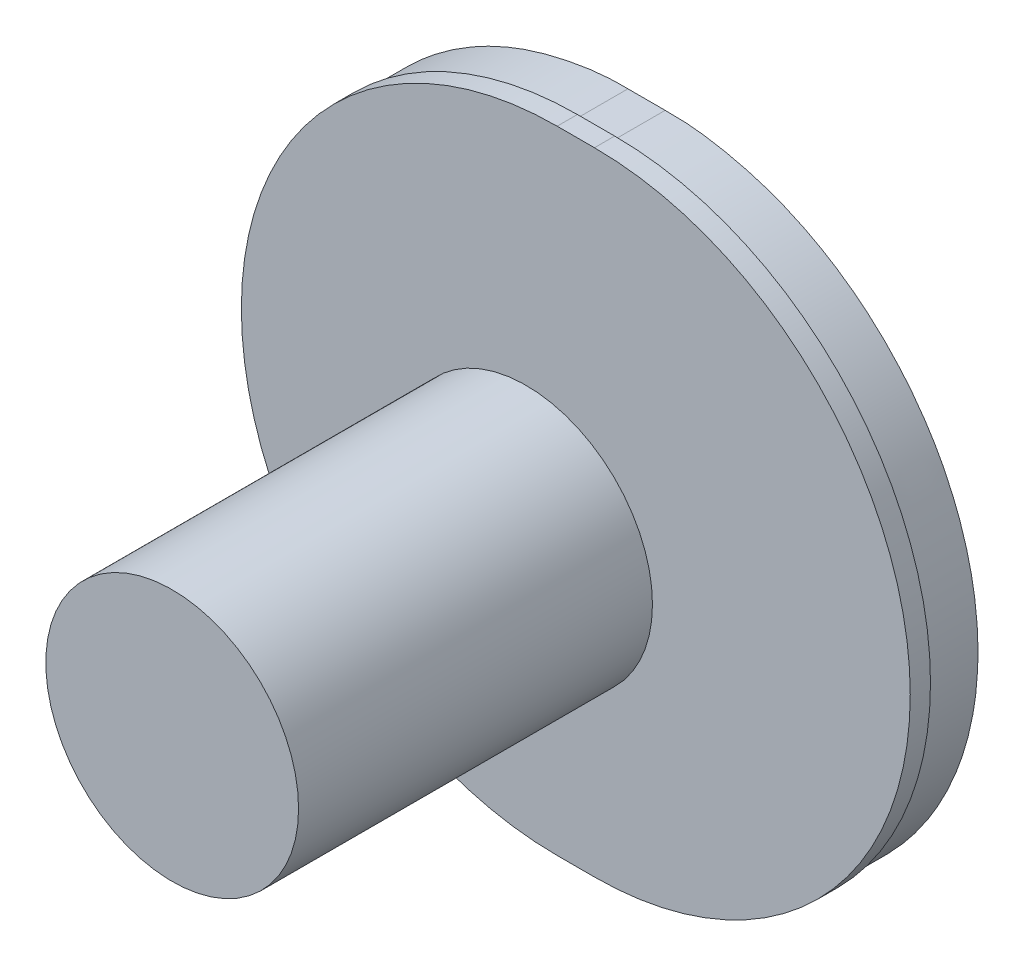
ISO-10303-21;
HEADER;
FILE_DESCRIPTION(('STEP AP214'),'2;1');
FILE_NAME('part.step','',(''),(''),'','','');
FILE_SCHEMA(('AUTOMOTIVE_DESIGN { 1 0 10303 214 1 1 1 1 }'));
ENDSEC;
DATA;
#1=APPLICATION_CONTEXT('core data for automotive mechanical design processes');
#2=APPLICATION_PROTOCOL_DEFINITION('international standard','automotive_design',2000,#1);
#3=PRODUCT_CONTEXT('',#1,'mechanical');
#4=PRODUCT('Part','Part','',(#3));
#5=PRODUCT_RELATED_PRODUCT_CATEGORY('part','',(#4));
#6=PRODUCT_DEFINITION_FORMATION('','',#4);
#7=PRODUCT_DEFINITION_CONTEXT('part definition',#1,'design');
#8=PRODUCT_DEFINITION('design','',#6,#7);
#9=PRODUCT_DEFINITION_SHAPE('','',#8);
#10=(LENGTH_UNIT() NAMED_UNIT(*) SI_UNIT(.MILLI.,.METRE.));
#11=(NAMED_UNIT(*) PLANE_ANGLE_UNIT() SI_UNIT($,.RADIAN.));
#12=(NAMED_UNIT(*) SI_UNIT($,.STERADIAN.) SOLID_ANGLE_UNIT());
#13=UNCERTAINTY_MEASURE_WITH_UNIT(LENGTH_MEASURE(1.E-05),#10,'distance_accuracy_value','');
#14=(GEOMETRIC_REPRESENTATION_CONTEXT(3) GLOBAL_UNCERTAINTY_ASSIGNED_CONTEXT((#13)) GLOBAL_UNIT_ASSIGNED_CONTEXT((#10,
#11,#12)) REPRESENTATION_CONTEXT('',''));
#15=CARTESIAN_POINT('',(0.,0.,0.));
#16=DIRECTION('',(0.,0.,1.));
#17=DIRECTION('',(1.,0.,0.));
#18=AXIS2_PLACEMENT_3D('',#15,#16,#17);
#19=CARTESIAN_POINT('',(0.,0.,35.4593662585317));
#20=DIRECTION('',(0.,0.,1.));
#21=DIRECTION('',(1.,0.,0.));
#22=AXIS2_PLACEMENT_3D('',#19,#20,#21);
#23=CYLINDRICAL_SURFACE('',#22,12.5);
#24=CARTESIAN_POINT('',(0.,0.,35.4593662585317));
#25=DIRECTION('',(0.,0.,1.));
#26=DIRECTION('',(1.,0.,0.));
#27=AXIS2_PLACEMENT_3D('',#24,#25,#26);
#28=CIRCLE('',#27,12.5);
#29=CARTESIAN_POINT('',(12.5,0.,35.4593662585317));
#30=VERTEX_POINT('',#29);
#31=EDGE_CURVE('E280',#30,#30,#28,.T.);
#32=ORIENTED_EDGE('',*,*,#31,.T.);
#33=EDGE_LOOP('',(#32));
#34=FACE_BOUND('',#33,.T.);
#35=CARTESIAN_POINT('',(0.,0.,70.4593662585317));
#36=DIRECTION('',(0.,0.,1.));
#37=DIRECTION('',(1.,0.,0.));
#38=AXIS2_PLACEMENT_3D('',#35,#36,#37);
#39=CIRCLE('',#38,12.5);
#40=CARTESIAN_POINT('',(12.5,0.,70.4593662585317));
#41=VERTEX_POINT('',#40);
#42=EDGE_CURVE('E275',#41,#41,#39,.T.);
#43=ORIENTED_EDGE('',*,*,#42,.F.);
#44=EDGE_LOOP('',(#43));
#45=FACE_BOUND('',#44,.T.);
#46=ADVANCED_FACE('F272',(#34,#45),#23,.T.);
#47=CARTESIAN_POINT('',(0.,0.,35.4593662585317));
#48=DIRECTION('',(0.,0.,1.));
#49=DIRECTION('',(1.,0.,0.));
#50=AXIS2_PLACEMENT_3D('',#47,#48,#49);
#51=PLANE('',#50);
#52=CARTESIAN_POINT('',(0.,0.,35.4593662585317));
#53=DIRECTION('',(0.,0.,-1.));
#54=DIRECTION('',(-1.,0.,0.));
#55=AXIS2_PLACEMENT_3D('',#52,#53,#54);
#56=CIRCLE('',#55,5.);
#57=CARTESIAN_POINT('',(-5.,0.,35.4593662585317));
#58=VERTEX_POINT('',#57);
#59=EDGE_CURVE('E14',#58,#58,#56,.T.);
#60=ORIENTED_EDGE('',*,*,#59,.F.);
#61=EDGE_LOOP('',(#60));
#62=FACE_BOUND('',#61,.T.);
#63=ORIENTED_EDGE('',*,*,#31,.F.);
#64=EDGE_LOOP('',(#63));
#65=FACE_BOUND('',#64,.T.);
#66=ADVANCED_FACE('F522',(#62,#65),#51,.F.);
#67=CARTESIAN_POINT('',(0.,0.,70.4593662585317));
#68=DIRECTION('',(0.,0.,1.));
#69=DIRECTION('',(1.,0.,0.));
#70=AXIS2_PLACEMENT_3D('',#67,#68,#69);
#71=PLANE('',#70);
#72=ORIENTED_EDGE('',*,*,#42,.T.);
#73=EDGE_LOOP('',(#72));
#74=FACE_BOUND('',#73,.T.);
#75=ADVANCED_FACE('F519',(#74),#71,.T.);
#76=CARTESIAN_POINT('',(0.,0.,30.4593662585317));
#77=DIRECTION('',(0.,0.,1.));
#78=DIRECTION('',(1.,0.,0.));
#79=AXIS2_PLACEMENT_3D('',#76,#77,#78);
#80=CYLINDRICAL_SURFACE('',#79,5.);
#81=CARTESIAN_POINT('',(0.,0.,30.4593662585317));
#82=DIRECTION('',(0.,0.,-1.));
#83=DIRECTION('',(-1.,0.,0.));
#84=AXIS2_PLACEMENT_3D('',#81,#82,#83);
#85=CIRCLE('',#84,5.);
#86=CARTESIAN_POINT('',(-5.,0.,30.4593662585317));
#87=VERTEX_POINT('',#86);
#88=EDGE_CURVE('E511',#87,#87,#85,.T.);
#89=ORIENTED_EDGE('',*,*,#88,.F.);
#90=EDGE_LOOP('',(#89));
#91=FACE_BOUND('',#90,.T.);
#92=ORIENTED_EDGE('',*,*,#59,.T.);
#93=EDGE_LOOP('',(#92));
#94=FACE_BOUND('',#93,.T.);
#95=ADVANCED_FACE('F531',(#91,#94),#80,.T.);
#96=CARTESIAN_POINT('',(1.76409122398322,0.,28.4593662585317));
#97=DIRECTION('',(0.,0.,1.));
#98=DIRECTION('',(1.,0.,0.));
#99=AXIS2_PLACEMENT_3D('',#96,#97,#98);
#100=CYLINDRICAL_SURFACE('',#99,31.23281308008);
#101=CARTESIAN_POINT('',(1.76409122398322,0.,30.4593662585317));
#102=DIRECTION('',(0.,0.,-1.));
#103=DIRECTION('',(-1.,0.,0.));
#104=AXIS2_PLACEMENT_3D('',#101,#102,#103);
#105=CIRCLE('',#104,31.23281308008);
#106=CARTESIAN_POINT('',(1.76409122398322,31.23281308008,30.4593662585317));
#107=VERTEX_POINT('',#106);
#108=CARTESIAN_POINT('',(1.76409122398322,-31.23281308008,30.4593662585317));
#109=VERTEX_POINT('',#108);
#110=EDGE_CURVE('E491',#107,#109,#105,.T.);
#111=ORIENTED_EDGE('',*,*,#110,.T.);
#112=DIRECTION('',(0.,0.,1.));
#113=VECTOR('',#112,1.);
#114=CARTESIAN_POINT('',(1.76409122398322,-31.23281308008,28.4593662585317));
#115=LINE('',#114,#113);
#116=CARTESIAN_POINT('',(1.76409122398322,-31.23281308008,28.4593662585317));
#117=VERTEX_POINT('',#116);
#118=EDGE_CURVE('E508',#117,#109,#115,.T.);
#119=ORIENTED_EDGE('',*,*,#118,.F.);
#120=CARTESIAN_POINT('',(1.76409122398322,0.,28.4593662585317));
#121=DIRECTION('',(0.,0.,-1.));
#122=DIRECTION('',(-1.,0.,0.));
#123=AXIS2_PLACEMENT_3D('',#120,#121,#122);
#124=CIRCLE('',#123,31.23281308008);
#125=CARTESIAN_POINT('',(1.76409122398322,31.23281308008,28.4593662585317));
#126=VERTEX_POINT('',#125);
#127=EDGE_CURVE('E480',#126,#117,#124,.T.);
#128=ORIENTED_EDGE('',*,*,#127,.F.);
#129=DIRECTION('',(0.,0.,1.));
#130=VECTOR('',#129,1.);
#131=CARTESIAN_POINT('',(1.76409122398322,31.23281308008,28.4593662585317));
#132=LINE('',#131,#130);
#133=EDGE_CURVE('E490',#126,#107,#132,.T.);
#134=ORIENTED_EDGE('',*,*,#133,.T.);
#135=EDGE_LOOP('',(#111,#119,#128,#134));
#136=FACE_BOUND('',#135,.T.);
#137=ADVANCED_FACE('F537',(#136),#100,.T.);
#138=CARTESIAN_POINT('',(1.76409122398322,-31.23281308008,28.4593662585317));
#139=DIRECTION('',(0.,1.,0.));
#140=DIRECTION('',(0.,0.,1.));
#141=AXIS2_PLACEMENT_3D('',#138,#139,#140);
#142=PLANE('',#141);
#143=DIRECTION('',(-1.,0.,0.));
#144=VECTOR('',#143,1.);
#145=CARTESIAN_POINT('',(1.76409122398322,-31.23281308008,30.4593662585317));
#146=LINE('',#145,#144);
#147=CARTESIAN_POINT('',(-1.9264467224,-31.23281308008,30.4593662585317));
#148=VERTEX_POINT('',#147);
#149=EDGE_CURVE('E494',#109,#148,#146,.T.);
#150=ORIENTED_EDGE('',*,*,#149,.T.);
#151=DIRECTION('',(0.,0.,1.));
#152=VECTOR('',#151,1.);
#153=CARTESIAN_POINT('',(-1.9264467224,-31.23281308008,28.4593662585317));
#154=LINE('',#153,#152);
#155=CARTESIAN_POINT('',(-1.9264467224,-31.23281308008,28.4593662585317));
#156=VERTEX_POINT('',#155);
#157=EDGE_CURVE('E505',#156,#148,#154,.T.);
#158=ORIENTED_EDGE('',*,*,#157,.F.);
#159=DIRECTION('',(-1.,0.,0.));
#160=VECTOR('',#159,1.);
#161=CARTESIAN_POINT('',(1.76409122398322,-31.23281308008,28.4593662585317));
#162=LINE('',#161,#160);
#163=EDGE_CURVE('E483',#117,#156,#162,.T.);
#164=ORIENTED_EDGE('',*,*,#163,.F.);
#165=ORIENTED_EDGE('',*,*,#118,.T.);
#166=EDGE_LOOP('',(#150,#158,#164,#165));
#167=FACE_BOUND('',#166,.T.);
#168=ADVANCED_FACE('F541',(#167),#142,.F.);
#169=CARTESIAN_POINT('',(-1.92644672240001,0.,28.4593662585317));
#170=DIRECTION('',(0.,0.,1.));
#171=DIRECTION('',(1.,0.,0.));
#172=AXIS2_PLACEMENT_3D('',#169,#170,#171);
#173=CYLINDRICAL_SURFACE('',#172,31.23281308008);
#174=CARTESIAN_POINT('',(-1.92644672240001,0.,30.4593662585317));
#175=DIRECTION('',(0.,0.,-1.));
#176=DIRECTION('',(-1.,0.,0.));
#177=AXIS2_PLACEMENT_3D('',#174,#175,#176);
#178=CIRCLE('',#177,31.23281308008);
#179=CARTESIAN_POINT('',(-1.92644672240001,31.23281308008,30.4593662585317));
#180=VERTEX_POINT('',#179);
#181=EDGE_CURVE('E497',#148,#180,#178,.T.);
#182=ORIENTED_EDGE('',*,*,#181,.T.);
#183=DIRECTION('',(0.,0.,1.));
#184=VECTOR('',#183,1.);
#185=CARTESIAN_POINT('',(-1.92644672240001,31.23281308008,28.4593662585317));
#186=LINE('',#185,#184);
#187=CARTESIAN_POINT('',(-1.92644672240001,31.23281308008,28.4593662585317));
#188=VERTEX_POINT('',#187);
#189=EDGE_CURVE('E502',#188,#180,#186,.T.);
#190=ORIENTED_EDGE('',*,*,#189,.F.);
#191=CARTESIAN_POINT('',(-1.92644672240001,0.,28.4593662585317));
#192=DIRECTION('',(0.,0.,-1.));
#193=DIRECTION('',(-1.,0.,0.));
#194=AXIS2_PLACEMENT_3D('',#191,#192,#193);
#195=CIRCLE('',#194,31.23281308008);
#196=EDGE_CURVE('E486',#156,#188,#195,.T.);
#197=ORIENTED_EDGE('',*,*,#196,.F.);
#198=ORIENTED_EDGE('',*,*,#157,.T.);
#199=EDGE_LOOP('',(#182,#190,#197,#198));
#200=FACE_BOUND('',#199,.T.);
#201=ADVANCED_FACE('F545',(#200),#173,.T.);
#202=CARTESIAN_POINT('',(1.76409122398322,31.23281308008,28.4593662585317));
#203=DIRECTION('',(0.,-1.,0.));
#204=DIRECTION('',(0.,0.,-1.));
#205=AXIS2_PLACEMENT_3D('',#202,#203,#204);
#206=PLANE('',#205);
#207=DIRECTION('',(1.,0.,0.));
#208=VECTOR('',#207,1.);
#209=CARTESIAN_POINT('',(1.76409122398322,31.23281308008,30.4593662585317));
#210=LINE('',#209,#208);
#211=EDGE_CURVE('E484',#180,#107,#210,.T.);
#212=ORIENTED_EDGE('',*,*,#211,.T.);
#213=ORIENTED_EDGE('',*,*,#133,.F.);
#214=DIRECTION('',(1.,0.,0.));
#215=VECTOR('',#214,1.);
#216=CARTESIAN_POINT('',(1.76409122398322,31.23281308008,28.4593662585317));
#217=LINE('',#216,#215);
#218=EDGE_CURVE('E488',#188,#126,#217,.T.);
#219=ORIENTED_EDGE('',*,*,#218,.F.);
#220=ORIENTED_EDGE('',*,*,#189,.T.);
#221=EDGE_LOOP('',(#212,#213,#219,#220));
#222=FACE_BOUND('',#221,.T.);
#223=ADVANCED_FACE('F549',(#222),#206,.F.);
#224=CARTESIAN_POINT('',(1.76409122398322,0.,28.4593662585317));
#225=DIRECTION('',(0.,0.,-1.));
#226=DIRECTION('',(-1.,0.,0.));
#227=AXIS2_PLACEMENT_3D('',#224,#225,#226);
#228=PLANE('',#227);
#229=DIRECTION('',(-1.,0.,0.));
#230=VECTOR('',#229,1.);
#231=CARTESIAN_POINT('',(1.7639688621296,-30.93281308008,28.4593662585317));
#232=LINE('',#231,#230);
#233=CARTESIAN_POINT('',(1.7639688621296,-30.93281308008,28.4593662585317));
#234=VERTEX_POINT('',#233);
#235=CARTESIAN_POINT('',(-1.92644672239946,-30.93281308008,28.4593662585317));
#236=VERTEX_POINT('',#235);
#237=EDGE_CURVE('E288',#234,#236,#232,.T.);
#238=ORIENTED_EDGE('',*,*,#237,.F.);
#239=CARTESIAN_POINT('',(1.75912008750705,30.93281308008,28.4593662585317));
#240=CARTESIAN_POINT('',(1.76011431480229,30.93281308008,28.4593662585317));
#241=CARTESIAN_POINT('',(1.76110854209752,30.93281308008,28.4593662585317));
#242=CARTESIAN_POINT('',(2.12252526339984,30.9328130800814,28.4593662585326));
#243=CARTESIAN_POINT('',(2.48394212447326,30.932820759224,28.4593662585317));
#244=CARTESIAN_POINT('',(2.84530803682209,30.9300292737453,28.4593662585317));
#245=CARTESIAN_POINT('',(3.92611949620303,30.9049750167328,28.4593662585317));
#246=CARTESIAN_POINT('',(5.00556288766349,30.8047579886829,28.4593662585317));
#247=CARTESIAN_POINT('',(5.72347820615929,30.7101881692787,28.4593662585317));
#248=CARTESIAN_POINT('',(7.51121853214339,30.4184854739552,28.4593662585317));
#249=CARTESIAN_POINT('',(9.27442906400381,30.0238824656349,28.4593662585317));
#250=CARTESIAN_POINT('',(10.3210907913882,29.746687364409,28.4593662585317));
#251=CARTESIAN_POINT('',(12.3870173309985,29.1046522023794,28.4593662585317));
#252=CARTESIAN_POINT('',(14.3884145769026,28.2737703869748,28.4593662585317));
#253=CARTESIAN_POINT('',(15.3704111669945,27.8133904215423,28.4593662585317));
#254=CARTESIAN_POINT('',(17.2918608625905,26.8072975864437,28.4593662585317));
#255=CARTESIAN_POINT('',(19.1179447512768,25.6396293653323,28.4593662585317));
#256=CARTESIAN_POINT('',(20.0048987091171,25.0166970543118,28.4593662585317));
#257=CARTESIAN_POINT('',(21.7221375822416,23.6952273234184,28.4593662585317));
#258=CARTESIAN_POINT('',(23.3170522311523,22.227729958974,28.4593662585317));
#259=CARTESIAN_POINT('',(24.0819718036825,21.4595137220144,28.4593662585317));
#260=CARTESIAN_POINT('',(25.5428220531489,19.8582248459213,28.4593662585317));
#261=CARTESIAN_POINT('',(26.8578677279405,18.1353805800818,28.4593662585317));
#262=CARTESIAN_POINT('',(27.4773596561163,17.2458187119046,28.4593662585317));
#263=CARTESIAN_POINT('',(28.6371221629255,15.4149137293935,28.4593662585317));
#264=CARTESIAN_POINT('',(29.6321229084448,13.4894427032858,28.4593662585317));
#265=CARTESIAN_POINT('',(30.0872709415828,12.5055822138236,28.4593662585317));
#266=CARTESIAN_POINT('',(30.9105385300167,10.5006443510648,28.4593662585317));
#267=CARTESIAN_POINT('',(31.5551015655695,8.43133885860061,28.4593662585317));
#268=CARTESIAN_POINT('',(31.8320003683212,7.38326747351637,28.4593662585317));
#269=CARTESIAN_POINT('',(32.2936193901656,5.26563396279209,28.4593662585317));
#270=CARTESIAN_POINT('',(32.568054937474,3.11571204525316,28.4593662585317));
#271=CARTESIAN_POINT('',(32.658246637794,2.03543622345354,28.4593662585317));
#272=CARTESIAN_POINT('',(32.7441174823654,-0.130230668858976,28.4593662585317));
#273=CARTESIAN_POINT('',(32.6400423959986,-2.29509910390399,28.4593662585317));
#274=CARTESIAN_POINT('',(32.5407717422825,-3.37457849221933,28.4593662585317));
#275=CARTESIAN_POINT('',(32.248270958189,-5.52211718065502,28.4593662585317));
#276=CARTESIAN_POINT('',(31.7688647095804,-7.63579483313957,28.4593662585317));
#277=CARTESIAN_POINT('',(31.4831642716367,-8.68150119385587,28.4593662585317));
#278=CARTESIAN_POINT('',(30.8212268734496,-10.7453145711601,28.4593662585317));
#279=CARTESIAN_POINT('',(29.9811326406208,-12.7432604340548,28.4593662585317));
#280=CARTESIAN_POINT('',(29.5177292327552,-13.723259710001,28.4593662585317));
#281=CARTESIAN_POINT('',(28.5065756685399,-15.6402973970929,28.4593662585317));
#282=CARTESIAN_POINT('',(27.3314602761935,-17.4613862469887,28.4593662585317));
#283=CARTESIAN_POINT('',(26.7045111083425,-18.3457080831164,28.4593662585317));
#284=CARTESIAN_POINT('',(25.3750277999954,-20.057435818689,28.4593662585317));
#285=CARTESIAN_POINT('',(23.900770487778,-21.6463901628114,28.4593662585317));
#286=CARTESIAN_POINT('',(23.1294207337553,-22.4081497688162,28.4593662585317));
#287=CARTESIAN_POINT('',(21.5222238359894,-23.8621854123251,28.4593662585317));
#288=CARTESIAN_POINT('',(19.7939217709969,-25.1691570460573,28.4593662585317));
#289=CARTESIAN_POINT('',(18.9017569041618,-25.7846053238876,28.4593662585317));
#290=CARTESIAN_POINT('',(17.0659244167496,-26.9368837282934,28.4593662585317));
#291=CARTESIAN_POINT('',(15.1361362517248,-27.9268396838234,28.4593662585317));
#292=CARTESIAN_POINT('',(14.1503229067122,-28.3789668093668,28.4593662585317));
#293=CARTESIAN_POINT('',(12.1580395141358,-29.1864765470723,28.4593662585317));
#294=CARTESIAN_POINT('',(10.1036407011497,-29.8074373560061,28.4593662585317));
#295=CARTESIAN_POINT('',(9.07179249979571,-30.0728459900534,28.4593662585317));
#296=CARTESIAN_POINT('',(7.34008596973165,-30.4485461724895,28.4593662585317));
#297=CARTESIAN_POINT('',(5.58574697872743,-30.7250694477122,28.4593662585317));
#298=CARTESIAN_POINT('',(4.88486180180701,-30.814092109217,28.4593662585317));
#299=CARTESIAN_POINT('',(3.83980056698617,-30.9072890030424,28.4593662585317));
#300=CARTESIAN_POINT('',(2.79346652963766,-30.9302991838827,28.4593662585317));
#301=CARTESIAN_POINT('',(2.4503385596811,-30.9328132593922,28.4593662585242));
#302=CARTESIAN_POINT('',(2.10716597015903,-30.932813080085,28.4593662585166));
#303=CARTESIAN_POINT('',(1.76399333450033,-30.93281308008,28.4593662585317));
#304=CARTESIAN_POINT('',(1.7639688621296,-30.93281308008,28.4593662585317));
#305=B_SPLINE_CURVE_WITH_KNOTS('',5,(#239,#240,#241,#242,#243,#244,#245,#246,#247,#248,#249,
#250,#251,#252,#253,#254,#255,#256,#257,#258,#259,#260,#261,#262,#263,#264,#265,#266,#267,#268,
#269,#270,#271,#272,#273,#274,#275,#276,#277,#278,#279,#280,#281,#282,#283,#284,#285,#286,#287,
#288,#289,#290,#291,#292,#293,#294,#295,#296,#297,#298,#299,#300,#301,#302,#303,#304),
.UNSPECIFIED.,.F.,.F.,(6,2,3,3,3,3,3,3,3,3,3,3,3,3,3,3,3,3,3,3,3,1,6),(0.,5.12171215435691E-05,
0.0186182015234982,0.0557521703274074,0.111453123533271,0.167154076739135,0.222855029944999,
0.278555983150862,0.334256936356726,0.38995788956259,0.445658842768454,0.501359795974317,
0.557060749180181,0.612761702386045,0.668462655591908,0.724163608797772,0.779864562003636,
0.8355655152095,0.891266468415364,0.94607754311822,0.982321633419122,0.99999873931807,1.),.UNSPECIFIED.);
#306=CARTESIAN_POINT('',(1.75912008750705,30.93281308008,28.4593662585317));
#307=VERTEX_POINT('',#306);
#308=EDGE_CURVE('E293',#307,#234,#305,.T.);
#309=ORIENTED_EDGE('',*,*,#308,.F.);
#310=DIRECTION('',(1.,0.,0.));
#311=VECTOR('',#310,1.);
#312=CARTESIAN_POINT('',(-1.92644672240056,30.93281308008,28.4593662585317));
#313=LINE('',#312,#311);
#314=CARTESIAN_POINT('',(-1.92644672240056,30.93281308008,28.4593662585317));
#315=VERTEX_POINT('',#314);
#316=EDGE_CURVE('E651',#315,#307,#313,.T.);
#317=ORIENTED_EDGE('',*,*,#316,.F.);
#318=CARTESIAN_POINT('',(-1.92644672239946,-30.93281308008,28.4593662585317));
#319=CARTESIAN_POINT('',(-2.2868692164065,-30.93281308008,28.4593662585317));
#320=CARTESIAN_POINT('',(-2.64729171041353,-30.93281308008,28.4593662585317));
#321=CARTESIAN_POINT('',(-3.00766353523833,-30.9300292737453,28.4593662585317));
#322=CARTESIAN_POINT('',(-4.08847499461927,-30.9049750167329,28.4593662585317));
#323=CARTESIAN_POINT('',(-5.16791838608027,-30.8047579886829,28.4593662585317));
#324=CARTESIAN_POINT('',(-5.88583370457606,-30.7101881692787,28.4593662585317));
#325=CARTESIAN_POINT('',(-7.67357403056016,-30.4184854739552,28.4593662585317));
#326=CARTESIAN_POINT('',(-9.43678456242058,-30.0238824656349,28.4593662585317));
#327=CARTESIAN_POINT('',(-10.483446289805,-29.746687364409,28.4593662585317));
#328=CARTESIAN_POINT('',(-12.5493728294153,-29.1046522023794,28.4593662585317));
#329=CARTESIAN_POINT('',(-14.5507700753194,-28.2737703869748,28.4593662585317));
#330=CARTESIAN_POINT('',(-15.5327666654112,-27.8133904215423,28.4593662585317));
#331=CARTESIAN_POINT('',(-17.4542163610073,-26.8072975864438,28.4593662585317));
#332=CARTESIAN_POINT('',(-19.2803002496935,-25.6396293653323,28.4593662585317));
#333=CARTESIAN_POINT('',(-20.1672542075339,-25.0166970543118,28.4593662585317));
#334=CARTESIAN_POINT('',(-21.8844930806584,-23.6952273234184,28.4593662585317));
#335=CARTESIAN_POINT('',(-23.4794077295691,-22.227729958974,28.4593662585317));
#336=CARTESIAN_POINT('',(-24.2443273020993,-21.4595137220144,28.4593662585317));
#337=CARTESIAN_POINT('',(-25.7051775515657,-19.8582248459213,28.4593662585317));
#338=CARTESIAN_POINT('',(-27.0202232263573,-18.1353805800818,28.4593662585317));
#339=CARTESIAN_POINT('',(-27.6397151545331,-17.2458187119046,28.4593662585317));
#340=CARTESIAN_POINT('',(-28.7994776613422,-15.4149137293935,28.4593662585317));
#341=CARTESIAN_POINT('',(-29.7944784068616,-13.4894427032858,28.4593662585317));
#342=CARTESIAN_POINT('',(-30.2496264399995,-12.5055822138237,28.4593662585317));
#343=CARTESIAN_POINT('',(-31.0728940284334,-10.5006443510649,28.4593662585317));
#344=CARTESIAN_POINT('',(-31.7174570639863,-8.43133885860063,28.4593662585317));
#345=CARTESIAN_POINT('',(-31.994355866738,-7.38326747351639,28.4593662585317));
#346=CARTESIAN_POINT('',(-32.4559748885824,-5.26563396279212,28.4593662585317));
#347=CARTESIAN_POINT('',(-32.7304104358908,-3.11571204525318,28.4593662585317));
#348=CARTESIAN_POINT('',(-32.8206021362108,-2.03543622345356,28.4593662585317));
#349=CARTESIAN_POINT('',(-32.9064729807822,0.130230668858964,28.4593662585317));
#350=CARTESIAN_POINT('',(-32.8023978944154,2.29509910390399,28.4593662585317));
#351=CARTESIAN_POINT('',(-32.7031272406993,3.37457849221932,28.4593662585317));
#352=CARTESIAN_POINT('',(-32.4106264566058,5.52211718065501,28.4593662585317));
#353=CARTESIAN_POINT('',(-31.9312202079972,7.63579483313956,28.4593662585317));
#354=CARTESIAN_POINT('',(-31.6455197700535,8.68150119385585,28.4593662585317));
#355=CARTESIAN_POINT('',(-30.9835823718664,10.7453145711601,28.4593662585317));
#356=CARTESIAN_POINT('',(-30.1434881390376,12.7432604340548,28.4593662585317));
#357=CARTESIAN_POINT('',(-29.680084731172,13.723259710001,28.4593662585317));
#358=CARTESIAN_POINT('',(-28.6689311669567,15.6402973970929,28.4593662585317));
#359=CARTESIAN_POINT('',(-27.4938157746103,17.4613862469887,28.4593662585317));
#360=CARTESIAN_POINT('',(-26.8668666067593,18.3457080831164,28.4593662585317));
#361=CARTESIAN_POINT('',(-25.5373832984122,20.057435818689,28.4593662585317));
#362=CARTESIAN_POINT('',(-24.0631259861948,21.6463901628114,28.4593662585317));
#363=CARTESIAN_POINT('',(-23.2917762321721,22.4081497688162,28.4593662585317));
#364=CARTESIAN_POINT('',(-21.6845793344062,23.8621854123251,28.4593662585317));
#365=CARTESIAN_POINT('',(-19.9562772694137,25.1691570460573,28.4593662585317));
#366=CARTESIAN_POINT('',(-19.0641124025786,25.7846053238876,28.4593662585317));
#367=CARTESIAN_POINT('',(-17.2282799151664,26.9368837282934,28.4593662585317));
#368=CARTESIAN_POINT('',(-15.2984917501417,27.9268396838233,28.4593662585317));
#369=CARTESIAN_POINT('',(-14.312678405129,28.3789668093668,28.4593662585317));
#370=CARTESIAN_POINT('',(-12.3203950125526,29.1864765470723,28.4593662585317));
#371=CARTESIAN_POINT('',(-10.2659961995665,29.8074373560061,28.4593662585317));
#372=CARTESIAN_POINT('',(-9.23414799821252,30.0728459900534,28.4593662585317));
#373=CARTESIAN_POINT('',(-7.50244146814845,30.4485461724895,28.4593662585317));
#374=CARTESIAN_POINT('',(-5.74810247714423,30.7250694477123,28.4593662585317));
#375=CARTESIAN_POINT('',(-5.04721730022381,30.814092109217,28.4593662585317));
#376=CARTESIAN_POINT('',(-4.00215606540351,30.9072890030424,28.4593662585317));
#377=CARTESIAN_POINT('',(-2.95584649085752,30.9302986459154,28.4593662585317));
#378=CARTESIAN_POINT('',(-2.6127430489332,30.93281308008,28.4593662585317));
#379=CARTESIAN_POINT('',(-2.26959488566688,30.93281308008,28.4593662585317));
#380=CARTESIAN_POINT('',(-1.92644672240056,30.93281308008,28.4593662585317));
#381=B_SPLINE_CURVE_WITH_KNOTS('',5,(#318,#319,#320,#321,#322,#323,#324,#325,#326,#327,#328,
#329,#330,#331,#332,#333,#334,#335,#336,#337,#338,#339,#340,#341,#342,#343,#344,#345,#346,#347,
#348,#349,#350,#351,#352,#353,#354,#355,#356,#357,#358,#359,#360,#361,#362,#363,#364,#365,#366,
#367,#368,#369,#370,#371,#372,#373,#374,#375,#376,#377,#378,#379,#380),.UNSPECIFIED.,.F.,.F.,(6,
3,3,3,3,3,3,3,3,3,3,3,3,3,3,3,3,3,3,3,6),(0.,0.0185679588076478,0.0557038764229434,
0.111407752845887,0.16711162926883,0.222815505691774,0.278519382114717,0.33422325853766,
0.389927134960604,0.445631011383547,0.501334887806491,0.557038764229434,0.612742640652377,
0.668446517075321,0.724150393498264,0.779854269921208,0.835558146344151,0.891262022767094,
0.946075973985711,0.982321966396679,1.),.UNSPECIFIED.);
#382=EDGE_CURVE('E495',#236,#315,#381,.T.);
#383=ORIENTED_EDGE('',*,*,#382,.F.);
#384=EDGE_LOOP('',(#238,#309,#317,#383));
#385=FACE_BOUND('',#384,.T.);
#386=ORIENTED_EDGE('',*,*,#127,.T.);
#387=ORIENTED_EDGE('',*,*,#163,.T.);
#388=ORIENTED_EDGE('',*,*,#196,.T.);
#389=ORIENTED_EDGE('',*,*,#218,.T.);
#390=EDGE_LOOP('',(#386,#387,#388,#389));
#391=FACE_BOUND('',#390,.T.);
#392=ADVANCED_FACE('F553',(#385,#391),#228,.T.);
#393=CARTESIAN_POINT('',(1.76409122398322,0.,30.4593662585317));
#394=DIRECTION('',(0.,0.,-1.));
#395=DIRECTION('',(-1.,0.,0.));
#396=AXIS2_PLACEMENT_3D('',#393,#394,#395);
#397=PLANE('',#396);
#398=ORIENTED_EDGE('',*,*,#88,.T.);
#399=EDGE_LOOP('',(#398));
#400=FACE_BOUND('',#399,.T.);
#401=ORIENTED_EDGE('',*,*,#110,.F.);
#402=ORIENTED_EDGE('',*,*,#211,.F.);
#403=ORIENTED_EDGE('',*,*,#181,.F.);
#404=ORIENTED_EDGE('',*,*,#149,.F.);
#405=EDGE_LOOP('',(#401,#402,#403,#404));
#406=FACE_BOUND('',#405,.T.);
#407=ADVANCED_FACE('F555',(#400,#406),#397,.F.);
#408=CARTESIAN_POINT('',(0.,0.,23.4593662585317));
#409=DIRECTION('',(0.,0.,1.));
#410=DIRECTION('',(1.,0.,0.));
#411=AXIS2_PLACEMENT_3D('',#408,#409,#410);
#412=PLANE('',#411);
#413=CARTESIAN_POINT('',(-1.92644672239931,-27.23281308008,23.4593662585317));
#414=CARTESIAN_POINT('',(-2.24375761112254,-27.23281308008,23.4593662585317));
#415=CARTESIAN_POINT('',(-2.56106849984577,-27.23281308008,23.4593662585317));
#416=CARTESIAN_POINT('',(-2.87833478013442,-27.2303622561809,23.4593662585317));
#417=CARTESIAN_POINT('',(-3.82986597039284,-27.2083048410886,23.4593662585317));
#418=CARTESIAN_POINT('',(-4.78019273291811,-27.1200751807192,23.4593662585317));
#419=CARTESIAN_POINT('',(-5.41223527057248,-27.0368172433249,23.4593662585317));
#420=CARTESIAN_POINT('',(-6.98613668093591,-26.7800062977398,23.4593662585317));
#421=CARTESIAN_POINT('',(-8.5384424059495,-26.4326033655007,23.4593662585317));
#422=CARTESIAN_POINT('',(-9.45990865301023,-26.1885647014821,23.4593662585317));
#423=CARTESIAN_POINT('',(-11.2787212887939,-25.623325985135,23.4593662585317));
#424=CARTESIAN_POINT('',(-13.0407232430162,-24.8918293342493,23.4593662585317));
#425=CARTESIAN_POINT('',(-13.9052592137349,-24.4865172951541,23.4593662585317));
#426=CARTESIAN_POINT('',(-15.5968764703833,-23.6007673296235,23.4593662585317));
#427=CARTESIAN_POINT('',(-17.2045350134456,-22.5727686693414,23.4593662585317));
#428=CARTESIAN_POINT('',(-17.9853967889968,-22.0243478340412,23.4593662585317));
#429=CARTESIAN_POINT('',(-19.4972297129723,-20.8609444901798,23.4593662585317));
#430=CARTESIAN_POINT('',(-20.9013701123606,-19.5689804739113,23.4593662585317));
#431=CARTESIAN_POINT('',(-21.5747945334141,-18.8926537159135,23.4593662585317));
#432=CARTESIAN_POINT('',(-22.8609065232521,-17.4829015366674,23.4593662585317));
#433=CARTESIAN_POINT('',(-24.0186542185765,-15.9661337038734,23.4593662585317));
#434=CARTESIAN_POINT('',(-24.5640461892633,-15.1829759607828,23.4593662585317));
#435=CARTESIAN_POINT('',(-25.5850847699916,-13.5710729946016,23.4593662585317));
#436=CARTESIAN_POINT('',(-26.4610694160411,-11.8759154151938,23.4593662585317));
#437=CARTESIAN_POINT('',(-26.8617753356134,-11.0097384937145,23.4593662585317));
#438=CARTESIAN_POINT('',(-27.5865685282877,-9.24461943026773,23.4593662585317));
#439=CARTESIAN_POINT('',(-28.1540327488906,-7.42283201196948,23.4593662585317));
#440=CARTESIAN_POINT('',(-28.3978105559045,-6.50012472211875,23.4593662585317));
#441=CARTESIAN_POINT('',(-28.8042134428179,-4.63578999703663,23.4593662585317));
#442=CARTESIAN_POINT('',(-29.045822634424,-2.7430290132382,23.4593662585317));
#443=CARTESIAN_POINT('',(-29.1252261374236,-1.79196939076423,23.4593662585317));
#444=CARTESIAN_POINT('',(-29.2008256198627,0.114653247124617,23.4593662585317));
#445=CARTESIAN_POINT('',(-29.1091993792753,2.02057293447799,23.4593662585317));
#446=CARTESIAN_POINT('',(-29.0218028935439,2.97093138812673,23.4593662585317));
#447=CARTESIAN_POINT('',(-28.7642893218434,4.86159421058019,23.4593662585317));
#448=CARTESIAN_POINT('',(-28.3422268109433,6.72244625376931,23.4593662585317));
#449=CARTESIAN_POINT('',(-28.0907001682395,7.64307140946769,23.4593662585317));
#450=CARTESIAN_POINT('',(-27.5079398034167,9.4600236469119,23.4593662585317));
#451=CARTESIAN_POINT('',(-26.768332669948,11.2189870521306,23.4593662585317));
#452=CARTESIAN_POINT('',(-26.3603588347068,12.081764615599,23.4593662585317));
#453=CARTESIAN_POINT('',(-25.4701534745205,13.7694976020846,23.4593662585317));
#454=CARTESIAN_POINT('',(-24.4355984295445,15.3727585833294,23.4593662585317));
#455=CARTESIAN_POINT('',(-23.8836412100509,16.1513030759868,23.4593662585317));
#456=CARTESIAN_POINT('',(-22.713182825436,17.6582840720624,23.4593662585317));
#457=CARTESIAN_POINT('',(-21.4152674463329,19.0571771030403,23.4593662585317));
#458=CARTESIAN_POINT('',(-20.7361819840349,19.7278195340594,23.4593662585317));
#459=CARTESIAN_POINT('',(-19.3212284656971,21.0079320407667,23.4593662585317));
#460=CARTESIAN_POINT('',(-17.7996556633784,22.1585714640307,23.4593662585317));
#461=CARTESIAN_POINT('',(-17.0142062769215,22.7004034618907,23.4593662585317));
#462=CARTESIAN_POINT('',(-15.3979652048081,23.7148531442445,23.4593662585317));
#463=CARTESIAN_POINT('',(-13.6990068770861,24.5863964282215,23.4593662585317));
#464=CARTESIAN_POINT('',(-12.8311106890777,24.9844427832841,23.4593662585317));
#465=CARTESIAN_POINT('',(-11.0771324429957,25.6953629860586,23.4593662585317));
#466=CARTESIAN_POINT('',(-9.26846865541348,26.2420481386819,23.4593662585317));
#467=CARTESIAN_POINT('',(-8.36004402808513,26.4757101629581,23.4593662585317));
#468=CARTESIAN_POINT('',(-6.83547398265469,26.8064713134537,23.4593662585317));
#469=CARTESIAN_POINT('',(-5.29097863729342,27.0499185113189,23.4593662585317));
#470=CARTESIAN_POINT('',(-4.67392919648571,27.1282928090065,23.4593662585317));
#471=CARTESIAN_POINT('',(-3.75387200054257,27.2103420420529,23.4593662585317));
#472=CARTESIAN_POINT('',(-2.8327157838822,27.2305994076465,23.4593662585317));
#473=CARTESIAN_POINT('',(-2.53065234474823,27.23281308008,23.4593662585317));
#474=CARTESIAN_POINT('',(-2.22854953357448,27.23281308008,23.4593662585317));
#475=CARTESIAN_POINT('',(-1.92644672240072,27.23281308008,23.4593662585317));
#476=B_SPLINE_CURVE_WITH_KNOTS('',5,(#413,#414,#415,#416,#417,#418,#419,#420,#421,#422,#423,
#424,#425,#426,#427,#428,#429,#430,#431,#432,#433,#434,#435,#436,#437,#438,#439,#440,#441,#442,
#443,#444,#445,#446,#447,#448,#449,#450,#451,#452,#453,#454,#455,#456,#457,#458,#459,#460,#461,
#462,#463,#464,#465,#466,#467,#468,#469,#470,#471,#472,#473,#474,#475),.UNSPECIFIED.,.F.,.F.,(6,
3,3,3,3,3,3,3,3,3,3,3,3,3,3,3,3,3,3,3,6),(0.,0.0185679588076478,0.0557038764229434,
0.111407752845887,0.16711162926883,0.222815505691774,0.278519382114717,0.33422325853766,
0.389927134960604,0.445631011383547,0.501334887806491,0.557038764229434,0.612742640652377,
0.668446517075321,0.724150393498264,0.779854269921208,0.835558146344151,0.891262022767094,
0.946075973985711,0.982321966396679,1.),.UNSPECIFIED.);
#477=CARTESIAN_POINT('',(-1.92644672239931,-27.23281308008,23.4593662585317));
#478=VERTEX_POINT('',#477);
#479=CARTESIAN_POINT('',(-1.92644672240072,27.23281308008,23.4593662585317));
#480=VERTEX_POINT('',#479);
#481=EDGE_CURVE('E361',#478,#480,#476,.T.);
#482=ORIENTED_EDGE('',*,*,#481,.F.);
#483=DIRECTION('',(-1.,0.,0.));
#484=VECTOR('',#483,1.);
#485=CARTESIAN_POINT('',(1.76409122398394,-27.23281308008,23.4593662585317));
#486=LINE('',#485,#484);
#487=CARTESIAN_POINT('',(1.76409122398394,-27.23281308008,23.4593662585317));
#488=VERTEX_POINT('',#487);
#489=EDGE_CURVE('E694',#488,#478,#486,.T.);
#490=ORIENTED_EDGE('',*,*,#489,.F.);
#491=CARTESIAN_POINT('',(1.76409122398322,27.23281308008,23.4593662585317));
#492=CARTESIAN_POINT('',(2.08140211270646,27.23281308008,23.4593662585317));
#493=CARTESIAN_POINT('',(2.39871300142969,27.23281308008,23.4593662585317));
#494=CARTESIAN_POINT('',(2.71597928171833,27.2303622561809,23.4593662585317));
#495=CARTESIAN_POINT('',(3.66751047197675,27.2083048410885,23.4593662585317));
#496=CARTESIAN_POINT('',(4.61783723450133,27.1200751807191,23.4593662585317));
#497=CARTESIAN_POINT('',(5.2498797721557,27.0368172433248,23.4593662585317));
#498=CARTESIAN_POINT('',(6.82378118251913,26.7800062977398,23.4593662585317));
#499=CARTESIAN_POINT('',(8.37608690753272,26.4326033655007,23.4593662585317));
#500=CARTESIAN_POINT('',(9.29755315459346,26.1885647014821,23.4593662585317));
#501=CARTESIAN_POINT('',(11.1163657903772,25.623325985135,23.4593662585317));
#502=CARTESIAN_POINT('',(12.8783677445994,24.8918293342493,23.4593662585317));
#503=CARTESIAN_POINT('',(13.7429037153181,24.4865172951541,23.4593662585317));
#504=CARTESIAN_POINT('',(15.4345209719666,23.6007673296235,23.4593662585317));
#505=CARTESIAN_POINT('',(17.0421795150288,22.5727686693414,23.4593662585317));
#506=CARTESIAN_POINT('',(17.82304129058,22.0243478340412,23.4593662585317));
#507=CARTESIAN_POINT('',(19.3348742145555,20.8609444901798,23.4593662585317));
#508=CARTESIAN_POINT('',(20.7390146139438,19.5689804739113,23.4593662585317));
#509=CARTESIAN_POINT('',(21.4124390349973,18.8926537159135,23.4593662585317));
#510=CARTESIAN_POINT('',(22.6985510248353,17.4829015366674,23.4593662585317));
#511=CARTESIAN_POINT('',(23.8562987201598,15.9661337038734,23.4593662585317));
#512=CARTESIAN_POINT('',(24.4016906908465,15.1829759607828,23.4593662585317));
#513=CARTESIAN_POINT('',(25.4227292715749,13.5710729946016,23.4593662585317));
#514=CARTESIAN_POINT('',(26.2987139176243,11.8759154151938,23.4593662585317));
#515=CARTESIAN_POINT('',(26.6994198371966,11.0097384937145,23.4593662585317));
#516=CARTESIAN_POINT('',(27.424213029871,9.24461943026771,23.4593662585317));
#517=CARTESIAN_POINT('',(27.9916772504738,7.42283201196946,23.4593662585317));
#518=CARTESIAN_POINT('',(28.2354550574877,6.50012472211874,23.4593662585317));
#519=CARTESIAN_POINT('',(28.6418579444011,4.63578999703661,23.4593662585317));
#520=CARTESIAN_POINT('',(28.8834671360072,2.74302901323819,23.4593662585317));
#521=CARTESIAN_POINT('',(28.9628706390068,1.79196939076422,23.4593662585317));
#522=CARTESIAN_POINT('',(29.0384701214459,-0.114653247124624,23.4593662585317));
#523=CARTESIAN_POINT('',(28.9468438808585,-2.020572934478,23.4593662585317));
#524=CARTESIAN_POINT('',(28.8594473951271,-2.97093138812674,23.4593662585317));
#525=CARTESIAN_POINT('',(28.6019338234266,-4.86159421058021,23.4593662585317));
#526=CARTESIAN_POINT('',(28.1798713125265,-6.72244625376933,23.4593662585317));
#527=CARTESIAN_POINT('',(27.9283446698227,-7.6430714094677,23.4593662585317));
#528=CARTESIAN_POINT('',(27.3455843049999,-9.46002364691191,23.4593662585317));
#529=CARTESIAN_POINT('',(26.6059771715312,-11.2189870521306,23.4593662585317));
#530=CARTESIAN_POINT('',(26.1980033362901,-12.081764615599,23.4593662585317));
#531=CARTESIAN_POINT('',(25.3077979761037,-13.7694976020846,23.4593662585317));
#532=CARTESIAN_POINT('',(24.2732429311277,-15.3727585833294,23.4593662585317));
#533=CARTESIAN_POINT('',(23.7212857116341,-16.1513030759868,23.4593662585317));
#534=CARTESIAN_POINT('',(22.5508273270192,-17.6582840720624,23.4593662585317));
#535=CARTESIAN_POINT('',(21.2529119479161,-19.0571771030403,23.4593662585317));
#536=CARTESIAN_POINT('',(20.5738264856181,-19.7278195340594,23.4593662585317));
#537=CARTESIAN_POINT('',(19.1588729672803,-21.0079320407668,23.4593662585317));
#538=CARTESIAN_POINT('',(17.6373001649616,-22.1585714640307,23.4593662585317));
#539=CARTESIAN_POINT('',(16.8518507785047,-22.7004034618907,23.4593662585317));
#540=CARTESIAN_POINT('',(15.2356097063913,-23.7148531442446,23.4593662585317));
#541=CARTESIAN_POINT('',(13.5366513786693,-24.5863964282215,23.4593662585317));
#542=CARTESIAN_POINT('',(12.6687551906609,-24.9844427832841,23.4593662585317));
#543=CARTESIAN_POINT('',(10.9147769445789,-25.6953629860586,23.4593662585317));
#544=CARTESIAN_POINT('',(9.10611315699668,-26.2420481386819,23.4593662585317));
#545=CARTESIAN_POINT('',(8.19768852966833,-26.4757101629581,23.4593662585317));
#546=CARTESIAN_POINT('',(6.6731184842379,-26.8064713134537,23.4593662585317));
#547=CARTESIAN_POINT('',(5.12862313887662,-27.049918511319,23.4593662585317));
#548=CARTESIAN_POINT('',(4.51157369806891,-27.1282928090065,23.4593662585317));
#549=CARTESIAN_POINT('',(3.59151650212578,-27.2103420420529,23.4593662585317));
#550=CARTESIAN_POINT('',(2.67036028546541,-27.2305994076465,23.4593662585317));
#551=CARTESIAN_POINT('',(2.36829684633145,-27.23281308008,23.4593662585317));
#552=CARTESIAN_POINT('',(2.06619403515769,-27.23281308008,23.4593662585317));
#553=CARTESIAN_POINT('',(1.76409122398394,-27.23281308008,23.4593662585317));
#554=B_SPLINE_CURVE_WITH_KNOTS('',5,(#491,#492,#493,#494,#495,#496,#497,#498,#499,#500,#501,
#502,#503,#504,#505,#506,#507,#508,#509,#510,#511,#512,#513,#514,#515,#516,#517,#518,#519,#520,
#521,#522,#523,#524,#525,#526,#527,#528,#529,#530,#531,#532,#533,#534,#535,#536,#537,#538,#539,
#540,#541,#542,#543,#544,#545,#546,#547,#548,#549,#550,#551,#552,#553),.UNSPECIFIED.,.F.,.F.,(6,
3,3,3,3,3,3,3,3,3,3,3,3,3,3,3,3,3,3,3,6),(0.,0.0185679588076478,0.0557038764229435,
0.111407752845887,0.16711162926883,0.222815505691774,0.278519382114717,0.334223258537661,
0.389927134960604,0.445631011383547,0.501334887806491,0.557038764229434,0.612742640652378,
0.668446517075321,0.724150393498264,0.779854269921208,0.835558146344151,0.891262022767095,
0.946075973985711,0.982321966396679,1.),.UNSPECIFIED.);
#555=CARTESIAN_POINT('',(1.76409122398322,27.23281308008,23.4593662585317));
#556=VERTEX_POINT('',#555);
#557=EDGE_CURVE('E385',#556,#488,#554,.T.);
#558=ORIENTED_EDGE('',*,*,#557,.F.);
#559=DIRECTION('',(1.,0.,0.));
#560=VECTOR('',#559,1.);
#561=CARTESIAN_POINT('',(-1.92644672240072,27.23281308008,23.4593662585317));
#562=LINE('',#561,#560);
#563=EDGE_CURVE('E378',#480,#556,#562,.T.);
#564=ORIENTED_EDGE('',*,*,#563,.F.);
#565=EDGE_LOOP('',(#482,#490,#558,#564));
#566=FACE_BOUND('',#565,.T.);
#567=CARTESIAN_POINT('',(-1.92644672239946,-30.93281308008,23.4593662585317));
#568=CARTESIAN_POINT('',(-2.2868692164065,-30.93281308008,23.4593662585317));
#569=CARTESIAN_POINT('',(-2.64729171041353,-30.93281308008,23.4593662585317));
#570=CARTESIAN_POINT('',(-3.00766353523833,-30.9300292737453,23.4593662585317));
#571=CARTESIAN_POINT('',(-4.08847499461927,-30.9049750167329,23.4593662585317));
#572=CARTESIAN_POINT('',(-5.16791838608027,-30.8047579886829,23.4593662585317));
#573=CARTESIAN_POINT('',(-5.88583370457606,-30.7101881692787,23.4593662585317));
#574=CARTESIAN_POINT('',(-7.67357403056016,-30.4184854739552,23.4593662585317));
#575=CARTESIAN_POINT('',(-9.43678456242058,-30.0238824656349,23.4593662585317));
#576=CARTESIAN_POINT('',(-10.483446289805,-29.746687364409,23.4593662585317));
#577=CARTESIAN_POINT('',(-12.5493728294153,-29.1046522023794,23.4593662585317));
#578=CARTESIAN_POINT('',(-14.5507700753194,-28.2737703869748,23.4593662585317));
#579=CARTESIAN_POINT('',(-15.5327666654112,-27.8133904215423,23.4593662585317));
#580=CARTESIAN_POINT('',(-17.4542163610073,-26.8072975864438,23.4593662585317));
#581=CARTESIAN_POINT('',(-19.2803002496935,-25.6396293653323,23.4593662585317));
#582=CARTESIAN_POINT('',(-20.1672542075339,-25.0166970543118,23.4593662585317));
#583=CARTESIAN_POINT('',(-21.8844930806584,-23.6952273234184,23.4593662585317));
#584=CARTESIAN_POINT('',(-23.4794077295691,-22.227729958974,23.4593662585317));
#585=CARTESIAN_POINT('',(-24.2443273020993,-21.4595137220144,23.4593662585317));
#586=CARTESIAN_POINT('',(-25.7051775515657,-19.8582248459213,23.4593662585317));
#587=CARTESIAN_POINT('',(-27.0202232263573,-18.1353805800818,23.4593662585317));
#588=CARTESIAN_POINT('',(-27.6397151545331,-17.2458187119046,23.4593662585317));
#589=CARTESIAN_POINT('',(-28.7994776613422,-15.4149137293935,23.4593662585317));
#590=CARTESIAN_POINT('',(-29.7944784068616,-13.4894427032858,23.4593662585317));
#591=CARTESIAN_POINT('',(-30.2496264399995,-12.5055822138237,23.4593662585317));
#592=CARTESIAN_POINT('',(-31.0728940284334,-10.5006443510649,23.4593662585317));
#593=CARTESIAN_POINT('',(-31.7174570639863,-8.43133885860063,23.4593662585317));
#594=CARTESIAN_POINT('',(-31.994355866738,-7.38326747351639,23.4593662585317));
#595=CARTESIAN_POINT('',(-32.4559748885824,-5.26563396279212,23.4593662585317));
#596=CARTESIAN_POINT('',(-32.7304104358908,-3.11571204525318,23.4593662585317));
#597=CARTESIAN_POINT('',(-32.8206021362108,-2.03543622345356,23.4593662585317));
#598=CARTESIAN_POINT('',(-32.9064729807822,0.130230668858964,23.4593662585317));
#599=CARTESIAN_POINT('',(-32.8023978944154,2.29509910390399,23.4593662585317));
#600=CARTESIAN_POINT('',(-32.7031272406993,3.37457849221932,23.4593662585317));
#601=CARTESIAN_POINT('',(-32.4106264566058,5.52211718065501,23.4593662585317));
#602=CARTESIAN_POINT('',(-31.9312202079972,7.63579483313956,23.4593662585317));
#603=CARTESIAN_POINT('',(-31.6455197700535,8.68150119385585,23.4593662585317));
#604=CARTESIAN_POINT('',(-30.9835823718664,10.7453145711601,23.4593662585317));
#605=CARTESIAN_POINT('',(-30.1434881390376,12.7432604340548,23.4593662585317));
#606=CARTESIAN_POINT('',(-29.680084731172,13.723259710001,23.4593662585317));
#607=CARTESIAN_POINT('',(-28.6689311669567,15.6402973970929,23.4593662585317));
#608=CARTESIAN_POINT('',(-27.4938157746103,17.4613862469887,23.4593662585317));
#609=CARTESIAN_POINT('',(-26.8668666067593,18.3457080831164,23.4593662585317));
#610=CARTESIAN_POINT('',(-25.5373832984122,20.057435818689,23.4593662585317));
#611=CARTESIAN_POINT('',(-24.0631259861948,21.6463901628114,23.4593662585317));
#612=CARTESIAN_POINT('',(-23.2917762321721,22.4081497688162,23.4593662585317));
#613=CARTESIAN_POINT('',(-21.6845793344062,23.8621854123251,23.4593662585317));
#614=CARTESIAN_POINT('',(-19.9562772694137,25.1691570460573,23.4593662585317));
#615=CARTESIAN_POINT('',(-19.0641124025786,25.7846053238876,23.4593662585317));
#616=CARTESIAN_POINT('',(-17.2282799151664,26.9368837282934,23.4593662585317));
#617=CARTESIAN_POINT('',(-15.2984917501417,27.9268396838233,23.4593662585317));
#618=CARTESIAN_POINT('',(-14.312678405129,28.3789668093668,23.4593662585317));
#619=CARTESIAN_POINT('',(-12.3203950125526,29.1864765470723,23.4593662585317));
#620=CARTESIAN_POINT('',(-10.2659961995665,29.8074373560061,23.4593662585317));
#621=CARTESIAN_POINT('',(-9.23414799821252,30.0728459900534,23.4593662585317));
#622=CARTESIAN_POINT('',(-7.50244146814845,30.4485461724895,23.4593662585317));
#623=CARTESIAN_POINT('',(-5.74810247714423,30.7250694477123,23.4593662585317));
#624=CARTESIAN_POINT('',(-5.04721730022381,30.814092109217,23.4593662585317));
#625=CARTESIAN_POINT('',(-4.00215606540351,30.9072890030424,23.4593662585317));
#626=CARTESIAN_POINT('',(-2.95584649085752,30.9302986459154,23.4593662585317));
#627=CARTESIAN_POINT('',(-2.6127430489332,30.93281308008,23.4593662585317));
#628=CARTESIAN_POINT('',(-2.26959488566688,30.93281308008,23.4593662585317));
#629=CARTESIAN_POINT('',(-1.92644672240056,30.93281308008,23.4593662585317));
#630=B_SPLINE_CURVE_WITH_KNOTS('',5,(#567,#568,#569,#570,#571,#572,#573,#574,#575,#576,#577,
#578,#579,#580,#581,#582,#583,#584,#585,#586,#587,#588,#589,#590,#591,#592,#593,#594,#595,#596,
#597,#598,#599,#600,#601,#602,#603,#604,#605,#606,#607,#608,#609,#610,#611,#612,#613,#614,#615,
#616,#617,#618,#619,#620,#621,#622,#623,#624,#625,#626,#627,#628,#629),.UNSPECIFIED.,.F.,.F.,(6,
3,3,3,3,3,3,3,3,3,3,3,3,3,3,3,3,3,3,3,6),(0.,0.0185679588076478,0.0557038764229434,
0.111407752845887,0.16711162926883,0.222815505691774,0.278519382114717,0.33422325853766,
0.389927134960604,0.445631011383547,0.501334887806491,0.557038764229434,0.612742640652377,
0.668446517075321,0.724150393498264,0.779854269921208,0.835558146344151,0.891262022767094,
0.946075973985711,0.982321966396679,1.),.UNSPECIFIED.);
#631=CARTESIAN_POINT('',(-1.92644672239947,-30.9328130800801,23.4593662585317));
#632=VERTEX_POINT('',#631);
#633=CARTESIAN_POINT('',(-1.92644672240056,30.93281308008,23.4593662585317));
#634=VERTEX_POINT('',#633);
#635=EDGE_CURVE('E645',#632,#634,#630,.T.);
#636=ORIENTED_EDGE('',*,*,#635,.T.);
#637=DIRECTION('',(1.,0.,0.));
#638=VECTOR('',#637,1.);
#639=CARTESIAN_POINT('',(-1.92644672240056,30.93281308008,23.4593662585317));
#640=LINE('',#639,#638);
#641=CARTESIAN_POINT('',(1.75912008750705,30.93281308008,23.4593662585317));
#642=VERTEX_POINT('',#641);
#643=EDGE_CURVE('E460',#634,#642,#640,.T.);
#644=ORIENTED_EDGE('',*,*,#643,.T.);
#645=CARTESIAN_POINT('',(1.75912008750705,30.93281308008,23.4593662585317));
#646=CARTESIAN_POINT('',(1.76011431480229,30.93281308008,23.4593662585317));
#647=CARTESIAN_POINT('',(1.76110854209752,30.93281308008,23.4593662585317));
#648=CARTESIAN_POINT('',(2.12252526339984,30.9328130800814,23.4593662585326));
#649=CARTESIAN_POINT('',(2.48394212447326,30.932820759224,23.4593662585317));
#650=CARTESIAN_POINT('',(2.84530803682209,30.9300292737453,23.4593662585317));
#651=CARTESIAN_POINT('',(3.92611949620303,30.9049750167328,23.4593662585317));
#652=CARTESIAN_POINT('',(5.00556288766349,30.8047579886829,23.4593662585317));
#653=CARTESIAN_POINT('',(5.72347820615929,30.7101881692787,23.4593662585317));
#654=CARTESIAN_POINT('',(7.51121853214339,30.4184854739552,23.4593662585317));
#655=CARTESIAN_POINT('',(9.27442906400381,30.0238824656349,23.4593662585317));
#656=CARTESIAN_POINT('',(10.3210907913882,29.746687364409,23.4593662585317));
#657=CARTESIAN_POINT('',(12.3870173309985,29.1046522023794,23.4593662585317));
#658=CARTESIAN_POINT('',(14.3884145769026,28.2737703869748,23.4593662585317));
#659=CARTESIAN_POINT('',(15.3704111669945,27.8133904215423,23.4593662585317));
#660=CARTESIAN_POINT('',(17.2918608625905,26.8072975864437,23.4593662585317));
#661=CARTESIAN_POINT('',(19.1179447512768,25.6396293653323,23.4593662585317));
#662=CARTESIAN_POINT('',(20.0048987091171,25.0166970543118,23.4593662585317));
#663=CARTESIAN_POINT('',(21.7221375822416,23.6952273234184,23.4593662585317));
#664=CARTESIAN_POINT('',(23.3170522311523,22.227729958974,23.4593662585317));
#665=CARTESIAN_POINT('',(24.0819718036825,21.4595137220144,23.4593662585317));
#666=CARTESIAN_POINT('',(25.5428220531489,19.8582248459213,23.4593662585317));
#667=CARTESIAN_POINT('',(26.8578677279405,18.1353805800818,23.4593662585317));
#668=CARTESIAN_POINT('',(27.4773596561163,17.2458187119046,23.4593662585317));
#669=CARTESIAN_POINT('',(28.6371221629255,15.4149137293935,23.4593662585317));
#670=CARTESIAN_POINT('',(29.6321229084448,13.4894427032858,23.4593662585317));
#671=CARTESIAN_POINT('',(30.0872709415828,12.5055822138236,23.4593662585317));
#672=CARTESIAN_POINT('',(30.9105385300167,10.5006443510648,23.4593662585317));
#673=CARTESIAN_POINT('',(31.5551015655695,8.43133885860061,23.4593662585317));
#674=CARTESIAN_POINT('',(31.8320003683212,7.38326747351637,23.4593662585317));
#675=CARTESIAN_POINT('',(32.2936193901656,5.26563396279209,23.4593662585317));
#676=CARTESIAN_POINT('',(32.568054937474,3.11571204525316,23.4593662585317));
#677=CARTESIAN_POINT('',(32.658246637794,2.03543622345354,23.4593662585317));
#678=CARTESIAN_POINT('',(32.7441174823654,-0.130230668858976,23.4593662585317));
#679=CARTESIAN_POINT('',(32.6400423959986,-2.29509910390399,23.4593662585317));
#680=CARTESIAN_POINT('',(32.5407717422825,-3.37457849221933,23.4593662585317));
#681=CARTESIAN_POINT('',(32.248270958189,-5.52211718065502,23.4593662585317));
#682=CARTESIAN_POINT('',(31.7688647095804,-7.63579483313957,23.4593662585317));
#683=CARTESIAN_POINT('',(31.4831642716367,-8.68150119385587,23.4593662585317));
#684=CARTESIAN_POINT('',(30.8212268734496,-10.7453145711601,23.4593662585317));
#685=CARTESIAN_POINT('',(29.9811326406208,-12.7432604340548,23.4593662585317));
#686=CARTESIAN_POINT('',(29.5177292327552,-13.723259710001,23.4593662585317));
#687=CARTESIAN_POINT('',(28.5065756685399,-15.6402973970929,23.4593662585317));
#688=CARTESIAN_POINT('',(27.3314602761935,-17.4613862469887,23.4593662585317));
#689=CARTESIAN_POINT('',(26.7045111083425,-18.3457080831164,23.4593662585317));
#690=CARTESIAN_POINT('',(25.3750277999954,-20.057435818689,23.4593662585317));
#691=CARTESIAN_POINT('',(23.900770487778,-21.6463901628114,23.4593662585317));
#692=CARTESIAN_POINT('',(23.1294207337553,-22.4081497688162,23.4593662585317));
#693=CARTESIAN_POINT('',(21.5222238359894,-23.8621854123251,23.4593662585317));
#694=CARTESIAN_POINT('',(19.7939217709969,-25.1691570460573,23.4593662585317));
#695=CARTESIAN_POINT('',(18.9017569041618,-25.7846053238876,23.4593662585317));
#696=CARTESIAN_POINT('',(17.0659244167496,-26.9368837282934,23.4593662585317));
#697=CARTESIAN_POINT('',(15.1361362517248,-27.9268396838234,23.4593662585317));
#698=CARTESIAN_POINT('',(14.1503229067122,-28.3789668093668,23.4593662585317));
#699=CARTESIAN_POINT('',(12.1580395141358,-29.1864765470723,23.4593662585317));
#700=CARTESIAN_POINT('',(10.1036407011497,-29.8074373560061,23.4593662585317));
#701=CARTESIAN_POINT('',(9.07179249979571,-30.0728459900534,23.4593662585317));
#702=CARTESIAN_POINT('',(7.34008596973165,-30.4485461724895,23.4593662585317));
#703=CARTESIAN_POINT('',(5.58574697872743,-30.7250694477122,23.4593662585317));
#704=CARTESIAN_POINT('',(4.88486180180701,-30.814092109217,23.4593662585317));
#705=CARTESIAN_POINT('',(3.83980056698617,-30.9072890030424,23.4593662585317));
#706=CARTESIAN_POINT('',(2.79346652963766,-30.9302991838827,23.4593662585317));
#707=CARTESIAN_POINT('',(2.4503385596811,-30.9328132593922,23.4593662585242));
#708=CARTESIAN_POINT('',(2.10716597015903,-30.932813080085,23.4593662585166));
#709=CARTESIAN_POINT('',(1.76399333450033,-30.93281308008,23.4593662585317));
#710=CARTESIAN_POINT('',(1.7639688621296,-30.93281308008,23.4593662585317));
#711=B_SPLINE_CURVE_WITH_KNOTS('',5,(#645,#646,#647,#648,#649,#650,#651,#652,#653,#654,#655,
#656,#657,#658,#659,#660,#661,#662,#663,#664,#665,#666,#667,#668,#669,#670,#671,#672,#673,#674,
#675,#676,#677,#678,#679,#680,#681,#682,#683,#684,#685,#686,#687,#688,#689,#690,#691,#692,#693,
#694,#695,#696,#697,#698,#699,#700,#701,#702,#703,#704,#705,#706,#707,#708,#709,#710),
.UNSPECIFIED.,.F.,.F.,(6,2,3,3,3,3,3,3,3,3,3,3,3,3,3,3,3,3,3,3,3,1,6),(0.,5.12171215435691E-05,
0.0186182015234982,0.0557521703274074,0.111453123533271,0.167154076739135,0.222855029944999,
0.278555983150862,0.334256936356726,0.38995788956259,0.445658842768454,0.501359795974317,
0.557060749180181,0.612761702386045,0.668462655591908,0.724163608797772,0.779864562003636,
0.8355655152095,0.891266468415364,0.94607754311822,0.982321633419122,0.99999873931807,1.),.UNSPECIFIED.);
#712=CARTESIAN_POINT('',(1.7639688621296,-30.93281308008,23.4593662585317));
#713=VERTEX_POINT('',#712);
#714=EDGE_CURVE('E464',#642,#713,#711,.T.);
#715=ORIENTED_EDGE('',*,*,#714,.T.);
#716=DIRECTION('',(-1.,0.,0.));
#717=VECTOR('',#716,1.);
#718=CARTESIAN_POINT('',(1.7639688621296,-30.93281308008,23.4593662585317));
#719=LINE('',#718,#717);
#720=EDGE_CURVE('E477',#713,#632,#719,.T.);
#721=ORIENTED_EDGE('',*,*,#720,.T.);
#722=EDGE_LOOP('',(#636,#644,#715,#721));
#723=FACE_BOUND('',#722,.T.);
#724=ADVANCED_FACE('F383',(#566,#723),#412,.F.);
#725=CARTESIAN_POINT('',(1.7639688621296,-30.93281308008,28.4593662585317));
#726=DIRECTION('',(0.,-1.,0.));
#727=DIRECTION('',(1.,0.,0.));
#728=AXIS2_PLACEMENT_3D('',#725,#726,#727);
#729=PLANE('',#728);
#730=ORIENTED_EDGE('',*,*,#720,.F.);
#731=DIRECTION('',(0.,0.,-1.));
#732=VECTOR('',#731,1.);
#733=CARTESIAN_POINT('',(1.7639688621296,-30.93281308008,28.4593662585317));
#734=LINE('',#733,#732);
#735=EDGE_CURVE('E471',#234,#713,#734,.T.);
#736=ORIENTED_EDGE('',*,*,#735,.F.);
#737=ORIENTED_EDGE('',*,*,#237,.T.);
#738=DIRECTION('',(0.,0.,-1.));
#739=VECTOR('',#738,1.);
#740=CARTESIAN_POINT('',(-1.92644672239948,-30.9328130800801,28.4593662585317));
#741=LINE('',#740,#739);
#742=EDGE_CURVE('E466',#236,#632,#741,.T.);
#743=ORIENTED_EDGE('',*,*,#742,.T.);
#744=EDGE_LOOP('',(#730,#736,#737,#743));
#745=FACE_BOUND('',#744,.T.);
#746=ADVANCED_FACE('F431',(#745),#729,.T.);
#747=DIRECTION('',(0.,0.,-1.));
#748=VECTOR('',#747,1.);
#749=SURFACE_OF_LINEAR_EXTRUSION('',#305,#748);
#750=ORIENTED_EDGE('',*,*,#714,.F.);
#751=DIRECTION('',(0.,0.,-1.));
#752=VECTOR('',#751,1.);
#753=CARTESIAN_POINT('',(1.75912008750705,30.93281308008,28.4593662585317));
#754=LINE('',#753,#752);
#755=EDGE_CURVE('E461',#307,#642,#754,.T.);
#756=ORIENTED_EDGE('',*,*,#755,.F.);
#757=ORIENTED_EDGE('',*,*,#308,.T.);
#758=ORIENTED_EDGE('',*,*,#735,.T.);
#759=EDGE_LOOP('',(#750,#756,#757,#758));
#760=FACE_BOUND('',#759,.T.);
#761=ADVANCED_FACE('F434',(#760),#749,.T.);
#762=CARTESIAN_POINT('',(-1.92644672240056,30.93281308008,28.4593662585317));
#763=DIRECTION('',(0.,1.,0.));
#764=DIRECTION('',(-1.,0.,0.));
#765=AXIS2_PLACEMENT_3D('',#762,#763,#764);
#766=PLANE('',#765);
#767=ORIENTED_EDGE('',*,*,#643,.F.);
#768=DIRECTION('',(0.,0.,-1.));
#769=VECTOR('',#768,1.);
#770=CARTESIAN_POINT('',(-1.92644672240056,30.93281308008,28.4593662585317));
#771=LINE('',#770,#769);
#772=EDGE_CURVE('E649',#315,#634,#771,.T.);
#773=ORIENTED_EDGE('',*,*,#772,.F.);
#774=ORIENTED_EDGE('',*,*,#316,.T.);
#775=ORIENTED_EDGE('',*,*,#755,.T.);
#776=EDGE_LOOP('',(#767,#773,#774,#775));
#777=FACE_BOUND('',#776,.T.);
#778=ADVANCED_FACE('F439',(#777),#766,.T.);
#779=DIRECTION('',(0.,0.,-1.));
#780=VECTOR('',#779,1.);
#781=SURFACE_OF_LINEAR_EXTRUSION('',#381,#780);
#782=ORIENTED_EDGE('',*,*,#635,.F.);
#783=ORIENTED_EDGE('',*,*,#742,.F.);
#784=ORIENTED_EDGE('',*,*,#382,.T.);
#785=ORIENTED_EDGE('',*,*,#772,.T.);
#786=EDGE_LOOP('',(#782,#783,#784,#785));
#787=FACE_BOUND('',#786,.T.);
#788=ADVANCED_FACE('F558',(#787),#781,.T.);
#789=CARTESIAN_POINT('',(1.76409122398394,-27.23281308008,28.4593662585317));
#790=DIRECTION('',(0.,-1.,0.));
#791=DIRECTION('',(1.,0.,0.));
#792=AXIS2_PLACEMENT_3D('',#789,#790,#791);
#793=PLANE('',#792);
#794=ORIENTED_EDGE('',*,*,#489,.T.);
#795=DIRECTION('',(0.,0.,-1.));
#796=VECTOR('',#795,1.);
#797=CARTESIAN_POINT('',(-1.92644672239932,-27.2328130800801,28.4593662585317));
#798=LINE('',#797,#796);
#799=CARTESIAN_POINT('',(-1.92644672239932,-27.2328130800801,28.4593662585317));
#800=VERTEX_POINT('',#799);
#801=EDGE_CURVE('E367',#800,#478,#798,.T.);
#802=ORIENTED_EDGE('',*,*,#801,.F.);
#803=DIRECTION('',(-1.,0.,0.));
#804=VECTOR('',#803,1.);
#805=CARTESIAN_POINT('',(1.76409122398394,-27.23281308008,28.4593662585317));
#806=LINE('',#805,#804);
#807=CARTESIAN_POINT('',(1.76409122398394,-27.23281308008,28.4593662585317));
#808=VERTEX_POINT('',#807);
#809=EDGE_CURVE('E700',#808,#800,#806,.T.);
#810=ORIENTED_EDGE('',*,*,#809,.F.);
#811=DIRECTION('',(0.,0.,-1.));
#812=VECTOR('',#811,1.);
#813=CARTESIAN_POINT('',(1.76409122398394,-27.23281308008,28.4593662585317));
#814=LINE('',#813,#812);
#815=EDGE_CURVE('E696',#808,#488,#814,.T.);
#816=ORIENTED_EDGE('',*,*,#815,.T.);
#817=EDGE_LOOP('',(#794,#802,#810,#816));
#818=FACE_BOUND('',#817,.T.);
#819=ADVANCED_FACE('F423',(#818),#793,.F.);
#820=CARTESIAN_POINT('',(1.76409122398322,27.23281308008,28.4593662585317));
#821=CARTESIAN_POINT('',(2.08140211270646,27.23281308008,28.4593662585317));
#822=CARTESIAN_POINT('',(2.39871300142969,27.23281308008,28.4593662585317));
#823=CARTESIAN_POINT('',(2.71597928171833,27.2303622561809,28.4593662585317));
#824=CARTESIAN_POINT('',(3.66751047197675,27.2083048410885,28.4593662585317));
#825=CARTESIAN_POINT('',(4.61783723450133,27.1200751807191,28.4593662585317));
#826=CARTESIAN_POINT('',(5.2498797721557,27.0368172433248,28.4593662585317));
#827=CARTESIAN_POINT('',(6.82378118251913,26.7800062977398,28.4593662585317));
#828=CARTESIAN_POINT('',(8.37608690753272,26.4326033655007,28.4593662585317));
#829=CARTESIAN_POINT('',(9.29755315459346,26.1885647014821,28.4593662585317));
#830=CARTESIAN_POINT('',(11.1163657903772,25.623325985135,28.4593662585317));
#831=CARTESIAN_POINT('',(12.8783677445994,24.8918293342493,28.4593662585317));
#832=CARTESIAN_POINT('',(13.7429037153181,24.4865172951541,28.4593662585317));
#833=CARTESIAN_POINT('',(15.4345209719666,23.6007673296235,28.4593662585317));
#834=CARTESIAN_POINT('',(17.0421795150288,22.5727686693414,28.4593662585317));
#835=CARTESIAN_POINT('',(17.82304129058,22.0243478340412,28.4593662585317));
#836=CARTESIAN_POINT('',(19.3348742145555,20.8609444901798,28.4593662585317));
#837=CARTESIAN_POINT('',(20.7390146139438,19.5689804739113,28.4593662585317));
#838=CARTESIAN_POINT('',(21.4124390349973,18.8926537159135,28.4593662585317));
#839=CARTESIAN_POINT('',(22.6985510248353,17.4829015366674,28.4593662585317));
#840=CARTESIAN_POINT('',(23.8562987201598,15.9661337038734,28.4593662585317));
#841=CARTESIAN_POINT('',(24.4016906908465,15.1829759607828,28.4593662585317));
#842=CARTESIAN_POINT('',(25.4227292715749,13.5710729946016,28.4593662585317));
#843=CARTESIAN_POINT('',(26.2987139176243,11.8759154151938,28.4593662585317));
#844=CARTESIAN_POINT('',(26.6994198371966,11.0097384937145,28.4593662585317));
#845=CARTESIAN_POINT('',(27.424213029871,9.24461943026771,28.4593662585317));
#846=CARTESIAN_POINT('',(27.9916772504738,7.42283201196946,28.4593662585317));
#847=CARTESIAN_POINT('',(28.2354550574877,6.50012472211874,28.4593662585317));
#848=CARTESIAN_POINT('',(28.6418579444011,4.63578999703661,28.4593662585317));
#849=CARTESIAN_POINT('',(28.8834671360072,2.74302901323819,28.4593662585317));
#850=CARTESIAN_POINT('',(28.9628706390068,1.79196939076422,28.4593662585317));
#851=CARTESIAN_POINT('',(29.0384701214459,-0.114653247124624,28.4593662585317));
#852=CARTESIAN_POINT('',(28.9468438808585,-2.020572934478,28.4593662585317));
#853=CARTESIAN_POINT('',(28.8594473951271,-2.97093138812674,28.4593662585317));
#854=CARTESIAN_POINT('',(28.6019338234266,-4.86159421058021,28.4593662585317));
#855=CARTESIAN_POINT('',(28.1798713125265,-6.72244625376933,28.4593662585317));
#856=CARTESIAN_POINT('',(27.9283446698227,-7.6430714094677,28.4593662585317));
#857=CARTESIAN_POINT('',(27.3455843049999,-9.46002364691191,28.4593662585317));
#858=CARTESIAN_POINT('',(26.6059771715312,-11.2189870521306,28.4593662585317));
#859=CARTESIAN_POINT('',(26.1980033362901,-12.081764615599,28.4593662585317));
#860=CARTESIAN_POINT('',(25.3077979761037,-13.7694976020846,28.4593662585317));
#861=CARTESIAN_POINT('',(24.2732429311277,-15.3727585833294,28.4593662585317));
#862=CARTESIAN_POINT('',(23.7212857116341,-16.1513030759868,28.4593662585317));
#863=CARTESIAN_POINT('',(22.5508273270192,-17.6582840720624,28.4593662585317));
#864=CARTESIAN_POINT('',(21.2529119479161,-19.0571771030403,28.4593662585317));
#865=CARTESIAN_POINT('',(20.5738264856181,-19.7278195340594,28.4593662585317));
#866=CARTESIAN_POINT('',(19.1588729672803,-21.0079320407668,28.4593662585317));
#867=CARTESIAN_POINT('',(17.6373001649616,-22.1585714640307,28.4593662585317));
#868=CARTESIAN_POINT('',(16.8518507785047,-22.7004034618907,28.4593662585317));
#869=CARTESIAN_POINT('',(15.2356097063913,-23.7148531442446,28.4593662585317));
#870=CARTESIAN_POINT('',(13.5366513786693,-24.5863964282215,28.4593662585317));
#871=CARTESIAN_POINT('',(12.6687551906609,-24.9844427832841,28.4593662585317));
#872=CARTESIAN_POINT('',(10.9147769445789,-25.6953629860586,28.4593662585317));
#873=CARTESIAN_POINT('',(9.10611315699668,-26.2420481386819,28.4593662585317));
#874=CARTESIAN_POINT('',(8.19768852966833,-26.4757101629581,28.4593662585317));
#875=CARTESIAN_POINT('',(6.6731184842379,-26.8064713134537,28.4593662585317));
#876=CARTESIAN_POINT('',(5.12862313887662,-27.049918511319,28.4593662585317));
#877=CARTESIAN_POINT('',(4.51157369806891,-27.1282928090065,28.4593662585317));
#878=CARTESIAN_POINT('',(3.59151650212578,-27.2103420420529,28.4593662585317));
#879=CARTESIAN_POINT('',(2.67036028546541,-27.2305994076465,28.4593662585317));
#880=CARTESIAN_POINT('',(2.36829684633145,-27.23281308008,28.4593662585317));
#881=CARTESIAN_POINT('',(2.06619403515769,-27.23281308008,28.4593662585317));
#882=CARTESIAN_POINT('',(1.76409122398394,-27.23281308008,28.4593662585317));
#883=B_SPLINE_CURVE_WITH_KNOTS('',5,(#820,#821,#822,#823,#824,#825,#826,#827,#828,#829,#830,
#831,#832,#833,#834,#835,#836,#837,#838,#839,#840,#841,#842,#843,#844,#845,#846,#847,#848,#849,
#850,#851,#852,#853,#854,#855,#856,#857,#858,#859,#860,#861,#862,#863,#864,#865,#866,#867,#868,
#869,#870,#871,#872,#873,#874,#875,#876,#877,#878,#879,#880,#881,#882),.UNSPECIFIED.,.F.,.F.,(6,
3,3,3,3,3,3,3,3,3,3,3,3,3,3,3,3,3,3,3,6),(0.,0.0185679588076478,0.0557038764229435,
0.111407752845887,0.16711162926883,0.222815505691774,0.278519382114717,0.334223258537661,
0.389927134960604,0.445631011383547,0.501334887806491,0.557038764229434,0.612742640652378,
0.668446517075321,0.724150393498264,0.779854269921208,0.835558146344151,0.891262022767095,
0.946075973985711,0.982321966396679,1.),.UNSPECIFIED.);
#884=DIRECTION('',(0.,0.,-1.));
#885=VECTOR('',#884,1.);
#886=SURFACE_OF_LINEAR_EXTRUSION('',#883,#885);
#887=ORIENTED_EDGE('',*,*,#557,.T.);
#888=ORIENTED_EDGE('',*,*,#815,.F.);
#889=CARTESIAN_POINT('',(1.76409122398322,27.23281308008,28.4593662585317));
#890=VERTEX_POINT('',#889);
#891=EDGE_CURVE('E386',#890,#808,#883,.T.);
#892=ORIENTED_EDGE('',*,*,#891,.F.);
#893=DIRECTION('',(0.,0.,-1.));
#894=VECTOR('',#893,1.);
#895=CARTESIAN_POINT('',(1.76409122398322,27.23281308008,28.4593662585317));
#896=LINE('',#895,#894);
#897=EDGE_CURVE('E389',#890,#556,#896,.T.);
#898=ORIENTED_EDGE('',*,*,#897,.T.);
#899=EDGE_LOOP('',(#887,#888,#892,#898));
#900=FACE_BOUND('',#899,.T.);
#901=ADVANCED_FACE('F419',(#900),#886,.F.);
#902=CARTESIAN_POINT('',(-1.92644672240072,27.23281308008,28.4593662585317));
#903=DIRECTION('',(0.,1.,0.));
#904=DIRECTION('',(0.,0.,1.));
#905=AXIS2_PLACEMENT_3D('',#902,#903,#904);
#906=PLANE('',#905);
#907=ORIENTED_EDGE('',*,*,#563,.T.);
#908=ORIENTED_EDGE('',*,*,#897,.F.);
#909=DIRECTION('',(1.,0.,0.));
#910=VECTOR('',#909,1.);
#911=CARTESIAN_POINT('',(-1.92644672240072,27.23281308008,28.4593662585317));
#912=LINE('',#911,#910);
#913=CARTESIAN_POINT('',(-1.92644672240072,27.23281308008,28.4593662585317));
#914=VERTEX_POINT('',#913);
#915=EDGE_CURVE('E373',#914,#890,#912,.T.);
#916=ORIENTED_EDGE('',*,*,#915,.F.);
#917=DIRECTION('',(0.,0.,-1.));
#918=VECTOR('',#917,1.);
#919=CARTESIAN_POINT('',(-1.92644672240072,27.23281308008,28.4593662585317));
#920=LINE('',#919,#918);
#921=EDGE_CURVE('E364',#914,#480,#920,.T.);
#922=ORIENTED_EDGE('',*,*,#921,.T.);
#923=EDGE_LOOP('',(#907,#908,#916,#922));
#924=FACE_BOUND('',#923,.T.);
#925=ADVANCED_FACE('F376',(#924),#906,.F.);
#926=CARTESIAN_POINT('',(-1.92644672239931,-27.23281308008,28.4593662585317));
#927=CARTESIAN_POINT('',(-2.24375761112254,-27.23281308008,28.4593662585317));
#928=CARTESIAN_POINT('',(-2.56106849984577,-27.23281308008,28.4593662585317));
#929=CARTESIAN_POINT('',(-2.87833478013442,-27.2303622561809,28.4593662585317));
#930=CARTESIAN_POINT('',(-3.82986597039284,-27.2083048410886,28.4593662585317));
#931=CARTESIAN_POINT('',(-4.78019273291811,-27.1200751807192,28.4593662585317));
#932=CARTESIAN_POINT('',(-5.41223527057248,-27.0368172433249,28.4593662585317));
#933=CARTESIAN_POINT('',(-6.98613668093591,-26.7800062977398,28.4593662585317));
#934=CARTESIAN_POINT('',(-8.5384424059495,-26.4326033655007,28.4593662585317));
#935=CARTESIAN_POINT('',(-9.45990865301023,-26.1885647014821,28.4593662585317));
#936=CARTESIAN_POINT('',(-11.2787212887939,-25.623325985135,28.4593662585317));
#937=CARTESIAN_POINT('',(-13.0407232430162,-24.8918293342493,28.4593662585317));
#938=CARTESIAN_POINT('',(-13.9052592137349,-24.4865172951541,28.4593662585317));
#939=CARTESIAN_POINT('',(-15.5968764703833,-23.6007673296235,28.4593662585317));
#940=CARTESIAN_POINT('',(-17.2045350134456,-22.5727686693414,28.4593662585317));
#941=CARTESIAN_POINT('',(-17.9853967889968,-22.0243478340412,28.4593662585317));
#942=CARTESIAN_POINT('',(-19.4972297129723,-20.8609444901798,28.4593662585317));
#943=CARTESIAN_POINT('',(-20.9013701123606,-19.5689804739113,28.4593662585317));
#944=CARTESIAN_POINT('',(-21.5747945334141,-18.8926537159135,28.4593662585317));
#945=CARTESIAN_POINT('',(-22.8609065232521,-17.4829015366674,28.4593662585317));
#946=CARTESIAN_POINT('',(-24.0186542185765,-15.9661337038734,28.4593662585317));
#947=CARTESIAN_POINT('',(-24.5640461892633,-15.1829759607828,28.4593662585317));
#948=CARTESIAN_POINT('',(-25.5850847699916,-13.5710729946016,28.4593662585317));
#949=CARTESIAN_POINT('',(-26.4610694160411,-11.8759154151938,28.4593662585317));
#950=CARTESIAN_POINT('',(-26.8617753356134,-11.0097384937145,28.4593662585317));
#951=CARTESIAN_POINT('',(-27.5865685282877,-9.24461943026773,28.4593662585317));
#952=CARTESIAN_POINT('',(-28.1540327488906,-7.42283201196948,28.4593662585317));
#953=CARTESIAN_POINT('',(-28.3978105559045,-6.50012472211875,28.4593662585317));
#954=CARTESIAN_POINT('',(-28.8042134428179,-4.63578999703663,28.4593662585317));
#955=CARTESIAN_POINT('',(-29.045822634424,-2.7430290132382,28.4593662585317));
#956=CARTESIAN_POINT('',(-29.1252261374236,-1.79196939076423,28.4593662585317));
#957=CARTESIAN_POINT('',(-29.2008256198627,0.114653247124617,28.4593662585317));
#958=CARTESIAN_POINT('',(-29.1091993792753,2.02057293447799,28.4593662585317));
#959=CARTESIAN_POINT('',(-29.0218028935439,2.97093138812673,28.4593662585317));
#960=CARTESIAN_POINT('',(-28.7642893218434,4.86159421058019,28.4593662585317));
#961=CARTESIAN_POINT('',(-28.3422268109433,6.72244625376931,28.4593662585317));
#962=CARTESIAN_POINT('',(-28.0907001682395,7.64307140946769,28.4593662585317));
#963=CARTESIAN_POINT('',(-27.5079398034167,9.4600236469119,28.4593662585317));
#964=CARTESIAN_POINT('',(-26.768332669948,11.2189870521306,28.4593662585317));
#965=CARTESIAN_POINT('',(-26.3603588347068,12.081764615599,28.4593662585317));
#966=CARTESIAN_POINT('',(-25.4701534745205,13.7694976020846,28.4593662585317));
#967=CARTESIAN_POINT('',(-24.4355984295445,15.3727585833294,28.4593662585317));
#968=CARTESIAN_POINT('',(-23.8836412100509,16.1513030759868,28.4593662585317));
#969=CARTESIAN_POINT('',(-22.713182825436,17.6582840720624,28.4593662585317));
#970=CARTESIAN_POINT('',(-21.4152674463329,19.0571771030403,28.4593662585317));
#971=CARTESIAN_POINT('',(-20.7361819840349,19.7278195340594,28.4593662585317));
#972=CARTESIAN_POINT('',(-19.3212284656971,21.0079320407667,28.4593662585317));
#973=CARTESIAN_POINT('',(-17.7996556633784,22.1585714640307,28.4593662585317));
#974=CARTESIAN_POINT('',(-17.0142062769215,22.7004034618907,28.4593662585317));
#975=CARTESIAN_POINT('',(-15.3979652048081,23.7148531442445,28.4593662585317));
#976=CARTESIAN_POINT('',(-13.6990068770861,24.5863964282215,28.4593662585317));
#977=CARTESIAN_POINT('',(-12.8311106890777,24.9844427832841,28.4593662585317));
#978=CARTESIAN_POINT('',(-11.0771324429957,25.6953629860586,28.4593662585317));
#979=CARTESIAN_POINT('',(-9.26846865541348,26.2420481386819,28.4593662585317));
#980=CARTESIAN_POINT('',(-8.36004402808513,26.4757101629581,28.4593662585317));
#981=CARTESIAN_POINT('',(-6.83547398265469,26.8064713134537,28.4593662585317));
#982=CARTESIAN_POINT('',(-5.29097863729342,27.0499185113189,28.4593662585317));
#983=CARTESIAN_POINT('',(-4.67392919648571,27.1282928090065,28.4593662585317));
#984=CARTESIAN_POINT('',(-3.75387200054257,27.2103420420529,28.4593662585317));
#985=CARTESIAN_POINT('',(-2.8327157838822,27.2305994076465,28.4593662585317));
#986=CARTESIAN_POINT('',(-2.53065234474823,27.23281308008,28.4593662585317));
#987=CARTESIAN_POINT('',(-2.22854953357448,27.23281308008,28.4593662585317));
#988=CARTESIAN_POINT('',(-1.92644672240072,27.23281308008,28.4593662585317));
#989=B_SPLINE_CURVE_WITH_KNOTS('',5,(#926,#927,#928,#929,#930,#931,#932,#933,#934,#935,#936,
#937,#938,#939,#940,#941,#942,#943,#944,#945,#946,#947,#948,#949,#950,#951,#952,#953,#954,#955,
#956,#957,#958,#959,#960,#961,#962,#963,#964,#965,#966,#967,#968,#969,#970,#971,#972,#973,#974,
#975,#976,#977,#978,#979,#980,#981,#982,#983,#984,#985,#986,#987,#988),.UNSPECIFIED.,.F.,.F.,(6,
3,3,3,3,3,3,3,3,3,3,3,3,3,3,3,3,3,3,3,6),(0.,0.0185679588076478,0.0557038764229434,
0.111407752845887,0.16711162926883,0.222815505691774,0.278519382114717,0.33422325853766,
0.389927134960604,0.445631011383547,0.501334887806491,0.557038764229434,0.612742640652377,
0.668446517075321,0.724150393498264,0.779854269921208,0.835558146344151,0.891262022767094,
0.946075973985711,0.982321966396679,1.),.UNSPECIFIED.);
#990=DIRECTION('',(0.,0.,-1.));
#991=VECTOR('',#990,1.);
#992=SURFACE_OF_LINEAR_EXTRUSION('',#989,#991);
#993=ORIENTED_EDGE('',*,*,#481,.T.);
#994=ORIENTED_EDGE('',*,*,#921,.F.);
#995=EDGE_CURVE('E372',#800,#914,#989,.T.);
#996=ORIENTED_EDGE('',*,*,#995,.F.);
#997=ORIENTED_EDGE('',*,*,#801,.T.);
#998=EDGE_LOOP('',(#993,#994,#996,#997));
#999=FACE_BOUND('',#998,.T.);
#1000=ADVANCED_FACE('F363',(#999),#992,.F.);
#1001=CARTESIAN_POINT('',(0.,0.,28.4593662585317));
#1002=DIRECTION('',(0.,0.,-1.));
#1003=DIRECTION('',(-1.,0.,0.));
#1004=AXIS2_PLACEMENT_3D('',#1001,#1002,#1003);
#1005=CIRCLE('',#1004,3.);
#1006=CARTESIAN_POINT('',(-3.,0.,28.4593662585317));
#1007=VERTEX_POINT('',#1006);
#1008=EDGE_CURVE('E408',#1007,#1007,#1005,.T.);
#1009=ORIENTED_EDGE('',*,*,#1008,.F.);
#1010=EDGE_LOOP('',(#1009));
#1011=FACE_BOUND('',#1010,.T.);
#1012=ORIENTED_EDGE('',*,*,#891,.T.);
#1013=ORIENTED_EDGE('',*,*,#809,.T.);
#1014=ORIENTED_EDGE('',*,*,#995,.T.);
#1015=ORIENTED_EDGE('',*,*,#915,.T.);
#1016=EDGE_LOOP('',(#1012,#1013,#1014,#1015));
#1017=FACE_BOUND('',#1016,.T.);
#1018=ADVANCED_FACE('F430',(#1011,#1017),#228,.T.);
#1019=CARTESIAN_POINT('',(0.,0.,26.4593662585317));
#1020=DIRECTION('',(0.,0.,1.));
#1021=DIRECTION('',(1.,0.,0.));
#1022=AXIS2_PLACEMENT_3D('',#1019,#1020,#1021);
#1023=CYLINDRICAL_SURFACE('',#1022,3.);
#1024=CARTESIAN_POINT('',(0.,0.,26.4593662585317));
#1025=DIRECTION('',(0.,0.,-1.));
#1026=DIRECTION('',(-1.,0.,0.));
#1027=AXIS2_PLACEMENT_3D('',#1024,#1025,#1026);
#1028=CIRCLE('',#1027,3.);
#1029=CARTESIAN_POINT('',(-3.,0.,26.4593662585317));
#1030=VERTEX_POINT('',#1029);
#1031=EDGE_CURVE('E697',#1030,#1030,#1028,.T.);
#1032=ORIENTED_EDGE('',*,*,#1031,.F.);
#1033=EDGE_LOOP('',(#1032));
#1034=FACE_BOUND('',#1033,.T.);
#1035=ORIENTED_EDGE('',*,*,#1008,.T.);
#1036=EDGE_LOOP('',(#1035));
#1037=FACE_BOUND('',#1036,.T.);
#1038=ADVANCED_FACE('F707',(#1034,#1037),#1023,.T.);
#1039=CARTESIAN_POINT('',(0.,0.,26.4593662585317));
#1040=DIRECTION('',(0.,0.,-1.));
#1041=DIRECTION('',(-1.,0.,0.));
#1042=AXIS2_PLACEMENT_3D('',#1039,#1040,#1041);
#1043=PLANE('',#1042);
#1044=ORIENTED_EDGE('',*,*,#1031,.T.);
#1045=EDGE_LOOP('',(#1044));
#1046=FACE_BOUND('',#1045,.T.);
#1047=ADVANCED_FACE('F716',(#1046),#1043,.T.);
#1048=CLOSED_SHELL('',(#46,#66,#75,#95,#137,#168,#201,#223,#392,#407,#724,#746,#761,#778,#788,
#819,#901,#925,#1000,#1018,#1038,#1047));
#1049=MANIFOLD_SOLID_BREP('B2',#1048);
#1050=ADVANCED_BREP_SHAPE_REPRESENTATION('',(#18,#1049),#14);
#1051=SHAPE_DEFINITION_REPRESENTATION(#9,#1050);
ENDSEC;
END-ISO-10303-21;
